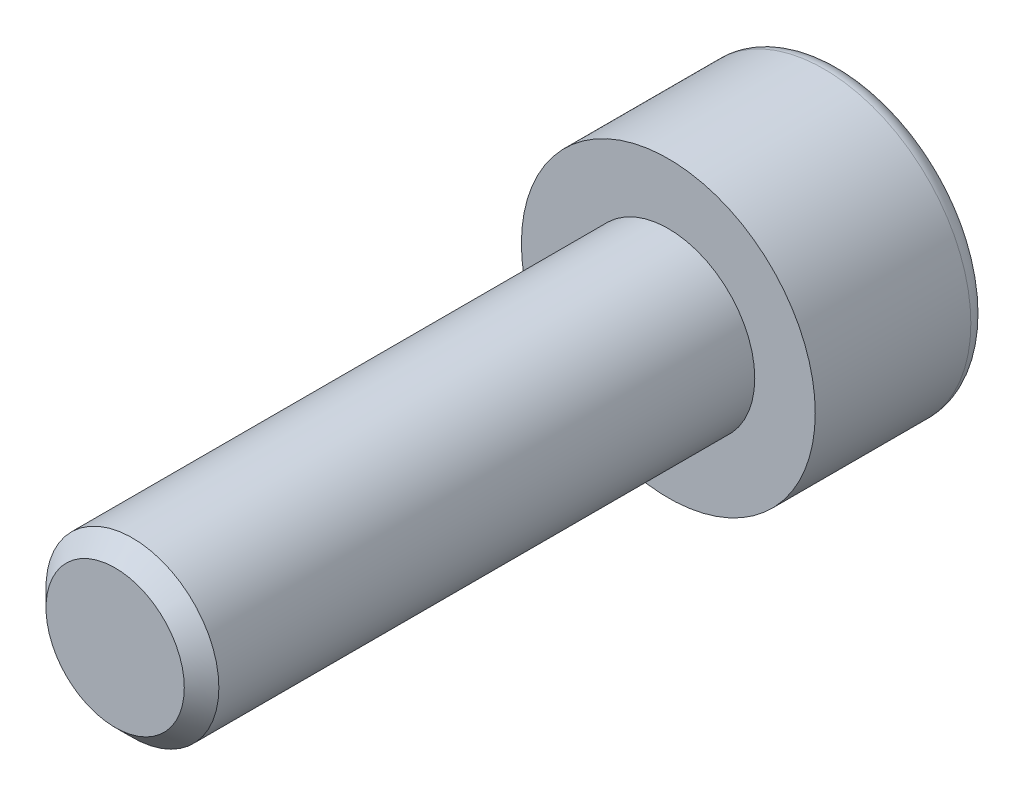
from build123d import *

# Parameters (mm, degrees)
ENLEV_MAT_EXTRU1_DEPTH = 2.5
ESQUISSE3_W            = 2.5
ESQUISSE3_H            = 16
CHANFREIN1_SIZE        = 0.5


with BuildPart() as part:
    # Esquisse1 → Base-R_volution (revolve)
    with BuildSketch(Plane(origin=(0, 0, 0), x_dir=(1, 0, 0), z_dir=(0, 1, 0)), mode=Mode.PRIVATE) as base_r_volution_sk:
        with BuildLine():
            Line((0, 0), (4.25, 0))
            Line((4.25, 0), (4.25, 4.5))
            ThreePointArc((4.25, 4.5), (4.103553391, 4.853553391), (3.75, 5))
            Line((3.75, 5), (0, 5))
            Line((0, 5), (0, 0))
        make_face()
    revolve(base_r_volution_sk.sketch.rotate(Axis((0, 0, 0), (0, 0, -1)), 180), axis=Axis((0, 0, 0), (0, 0, -1)))

    # Esquisse2 → enlev-mat-Extru1 (cut)
    with BuildSketch(Plane.XY.offset(-5)):
        Polygon((2, -1.154700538), (2, 1.154700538), (0, 2.309401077), (-2, 1.154700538), (-2, -1.154700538), (0, -2.309401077), align=None)
    extrude(amount=ENLEV_MAT_EXTRU1_DEPTH, mode=Mode.SUBTRACT)

    # Esquisse3 → Boss.-R_vol.1 (revolve)
    with BuildSketch(Plane(origin=(0, 0, 0), x_dir=(1, 0, 0), z_dir=(0, 1, 0))):
        with Locations((1.25, -8)):
            Rectangle(ESQUISSE3_W, ESQUISSE3_H)
    revolve(axis=Axis((0, 0, 0), (0, 0, 1)))

    # Chanfrein1
    chanfrein1_edges = [part.edges().sort_by_distance(p)[0] for p in [
        (-2.5, 0, 16),
    ]]
    chamfer(chanfrein1_edges, length=CHANFREIN1_SIZE)


solid = part.part
